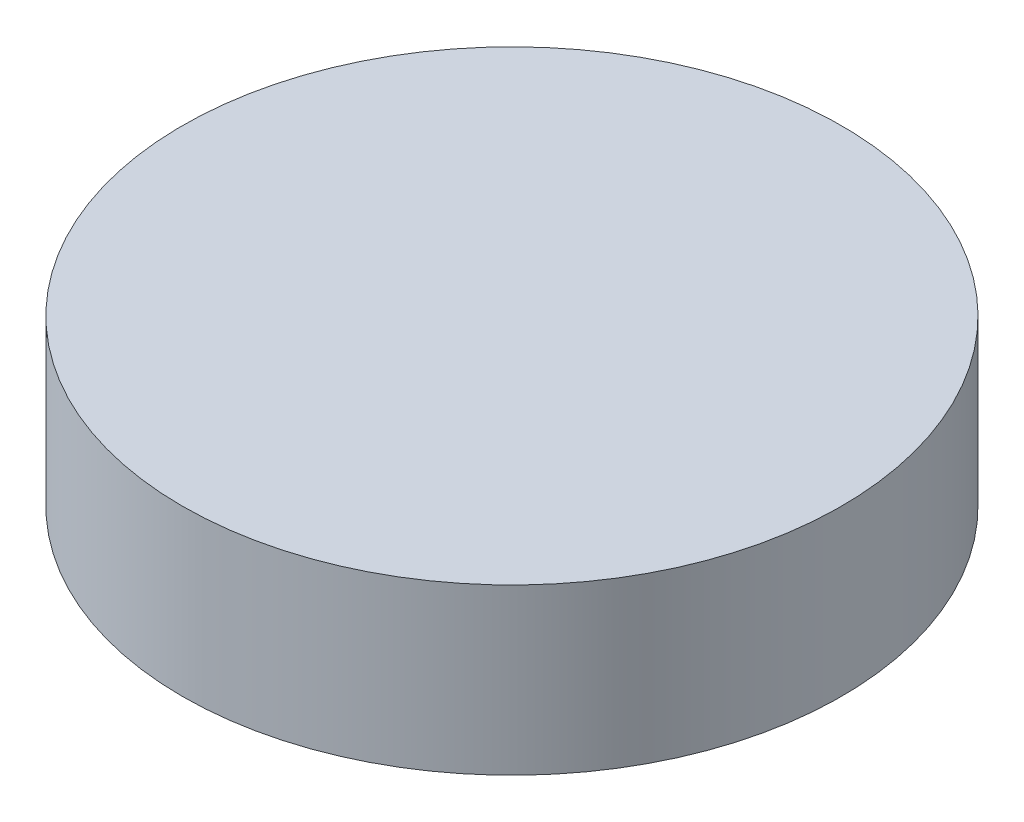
from build123d import *

# Parameters (mm, degrees)
SKETCH_1_R      = 4
EXTRUDE_1_DEPTH = 2


with BuildPart() as part:
    # Sketch 1 → Extrude 1 (new body)
    with BuildSketch(Plane(origin=(0, 0, 0), x_dir=(1, 0, 0), z_dir=(0, 1, 0))):
        with Locations(Location((0, 0, 0), (0, 0, 270))):
            Circle(SKETCH_1_R)
    extrude(amount=EXTRUDE_1_DEPTH)


solid = part.part
